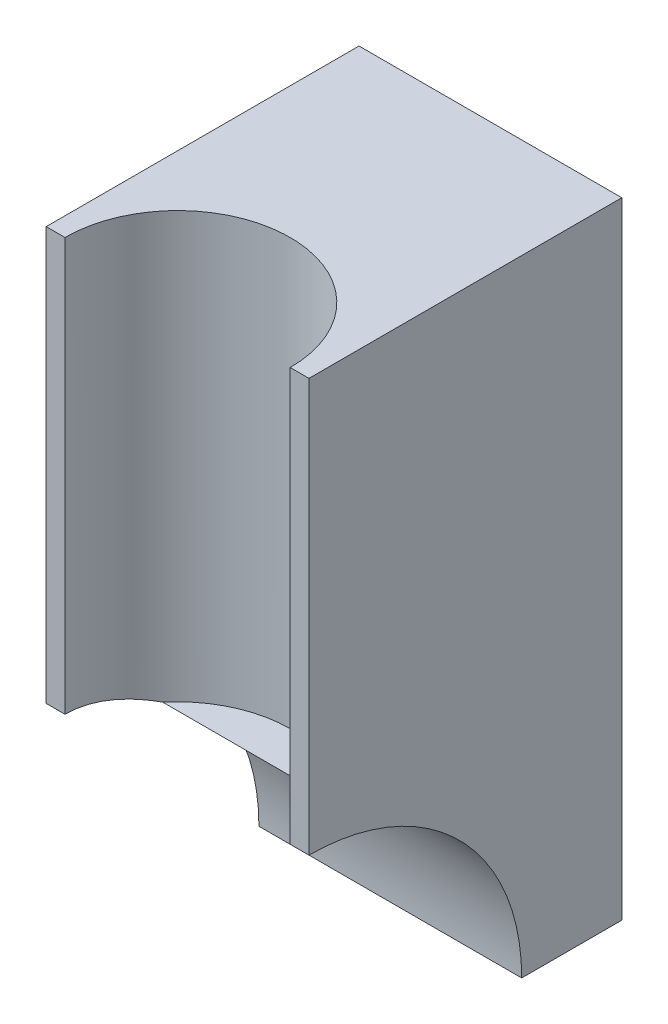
ISO-10303-21;
HEADER;
FILE_DESCRIPTION(('STEP AP214'),'2;1');
FILE_NAME('part.step','',(''),(''),'','','');
FILE_SCHEMA(('AUTOMOTIVE_DESIGN { 1 0 10303 214 1 1 1 1 }'));
ENDSEC;
DATA;
#1=APPLICATION_CONTEXT('core data for automotive mechanical design processes');
#2=APPLICATION_PROTOCOL_DEFINITION('international standard','automotive_design',2000,#1);
#3=PRODUCT_CONTEXT('',#1,'mechanical');
#4=PRODUCT('Part','Part','',(#3));
#5=PRODUCT_RELATED_PRODUCT_CATEGORY('part','',(#4));
#6=PRODUCT_DEFINITION_FORMATION('','',#4);
#7=PRODUCT_DEFINITION_CONTEXT('part definition',#1,'design');
#8=PRODUCT_DEFINITION('design','',#6,#7);
#9=PRODUCT_DEFINITION_SHAPE('','',#8);
#10=(LENGTH_UNIT() NAMED_UNIT(*) SI_UNIT(.MILLI.,.METRE.));
#11=(NAMED_UNIT(*) PLANE_ANGLE_UNIT() SI_UNIT($,.RADIAN.));
#12=(NAMED_UNIT(*) SI_UNIT($,.STERADIAN.) SOLID_ANGLE_UNIT());
#13=UNCERTAINTY_MEASURE_WITH_UNIT(LENGTH_MEASURE(1.E-05),#10,'distance_accuracy_value','');
#14=(GEOMETRIC_REPRESENTATION_CONTEXT(3) GLOBAL_UNCERTAINTY_ASSIGNED_CONTEXT((#13)) GLOBAL_UNIT_ASSIGNED_CONTEXT((#10,
#11,#12)) REPRESENTATION_CONTEXT('',''));
#15=CARTESIAN_POINT('',(0.,0.,0.));
#16=DIRECTION('',(0.,0.,1.));
#17=DIRECTION('',(1.,0.,0.));
#18=AXIS2_PLACEMENT_3D('',#15,#16,#17);
#19=CARTESIAN_POINT('',(-105.,500.,125.));
#20=DIRECTION('',(0.,0.,-1.));
#21=DIRECTION('',(-1.,0.,0.));
#22=AXIS2_PLACEMENT_3D('',#19,#20,#21);
#23=PLANE('',#22);
#24=DIRECTION('',(1.,0.,0.));
#25=VECTOR('',#24,1.);
#26=CARTESIAN_POINT('',(-105.,500.,125.));
#27=LINE('',#26,#25);
#28=CARTESIAN_POINT('',(90.,500.,125.));
#29=VERTEX_POINT('',#28);
#30=CARTESIAN_POINT('',(105.,500.,125.));
#31=VERTEX_POINT('',#30);
#32=EDGE_CURVE('E57',#29,#31,#27,.T.);
#33=ORIENTED_EDGE('',*,*,#32,.F.);
#34=DIRECTION('',(0.,1.,0.));
#35=VECTOR('',#34,1.);
#36=CARTESIAN_POINT('',(90.,160.,125.));
#37=LINE('',#36,#35);
#38=CARTESIAN_POINT('',(90.,170.,125.));
#39=VERTEX_POINT('',#38);
#40=EDGE_CURVE('E116',#29,#39,#37,.F.);
#41=ORIENTED_EDGE('',*,*,#40,.T.);
#42=DIRECTION('',(-1.,0.,0.));
#43=VECTOR('',#42,1.);
#44=CARTESIAN_POINT('',(920.199931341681,170.,125.));
#45=LINE('',#44,#43);
#46=CARTESIAN_POINT('',(105.,170.,125.));
#47=VERTEX_POINT('',#46);
#48=EDGE_CURVE('E122',#47,#39,#45,.T.);
#49=ORIENTED_EDGE('',*,*,#48,.F.);
#50=DIRECTION('',(0.,-1.,0.));
#51=VECTOR('',#50,1.);
#52=CARTESIAN_POINT('',(105.,500.,125.));
#53=LINE('',#52,#51);
#54=EDGE_CURVE('E165',#31,#47,#53,.T.);
#55=ORIENTED_EDGE('',*,*,#54,.F.);
#56=EDGE_LOOP('',(#33,#41,#49,#55));
#57=FACE_BOUND('',#56,.T.);
#58=ADVANCED_FACE('F30',(#57),#23,.F.);
#59=CARTESIAN_POINT('',(-90.,170.,125.));
#60=VERTEX_POINT('',#59);
#61=CARTESIAN_POINT('',(-105.,170.,125.));
#62=VERTEX_POINT('',#61);
#63=EDGE_CURVE('E202',#60,#62,#45,.T.);
#64=ORIENTED_EDGE('',*,*,#63,.F.);
#65=DIRECTION('',(0.,1.,0.));
#66=VECTOR('',#65,1.);
#67=CARTESIAN_POINT('',(-90.,160.,125.));
#68=LINE('',#67,#66);
#69=CARTESIAN_POINT('',(-90.,500.,125.));
#70=VERTEX_POINT('',#69);
#71=EDGE_CURVE('E203',#60,#70,#68,.T.);
#72=ORIENTED_EDGE('',*,*,#71,.T.);
#73=CARTESIAN_POINT('',(-105.,500.,125.));
#74=VERTEX_POINT('',#73);
#75=EDGE_CURVE('E161',#74,#70,#27,.T.);
#76=ORIENTED_EDGE('',*,*,#75,.F.);
#77=DIRECTION('',(0.,-1.,0.));
#78=VECTOR('',#77,1.);
#79=CARTESIAN_POINT('',(-105.,500.,125.));
#80=LINE('',#79,#78);
#81=EDGE_CURVE('E181',#74,#62,#80,.T.);
#82=ORIENTED_EDGE('',*,*,#81,.T.);
#83=EDGE_LOOP('',(#64,#72,#76,#82));
#84=FACE_BOUND('',#83,.T.);
#85=ADVANCED_FACE('F137',(#84),#23,.F.);
#86=CARTESIAN_POINT('',(105.,0.,125.));
#87=DIRECTION('',(0.,1.,0.));
#88=DIRECTION('',(0.,0.,1.));
#89=AXIS2_PLACEMENT_3D('',#86,#87,#88);
#90=PLANE('',#89);
#91=DIRECTION('',(-1.,0.,0.));
#92=VECTOR('',#91,1.);
#93=CARTESIAN_POINT('',(920.199931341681,0.,-45.0000000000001));
#94=LINE('',#93,#92);
#95=CARTESIAN_POINT('',(105.,0.,-45.));
#96=VERTEX_POINT('',#95);
#97=CARTESIAN_POINT('',(-105.,0.,-45.));
#98=VERTEX_POINT('',#97);
#99=EDGE_CURVE('E192',#96,#98,#94,.T.);
#100=ORIENTED_EDGE('',*,*,#99,.T.);
#101=DIRECTION('',(0.,0.,1.));
#102=VECTOR('',#101,1.);
#103=CARTESIAN_POINT('',(-105.,0.,-125.));
#104=LINE('',#103,#102);
#105=CARTESIAN_POINT('',(-105.,0.,-125.));
#106=VERTEX_POINT('',#105);
#107=EDGE_CURVE('E176',#106,#98,#104,.T.);
#108=ORIENTED_EDGE('',*,*,#107,.F.);
#109=DIRECTION('',(-1.,0.,0.));
#110=VECTOR('',#109,1.);
#111=CARTESIAN_POINT('',(-105.,0.,-125.));
#112=LINE('',#111,#110);
#113=CARTESIAN_POINT('',(105.,0.,-125.));
#114=VERTEX_POINT('',#113);
#115=EDGE_CURVE('E74',#114,#106,#112,.T.);
#116=ORIENTED_EDGE('',*,*,#115,.F.);
#117=DIRECTION('',(0.,0.,-1.));
#118=VECTOR('',#117,1.);
#119=CARTESIAN_POINT('',(105.,0.,-125.));
#120=LINE('',#119,#118);
#121=EDGE_CURVE('E172',#96,#114,#120,.T.);
#122=ORIENTED_EDGE('',*,*,#121,.F.);
#123=EDGE_LOOP('',(#100,#108,#116,#122));
#124=FACE_BOUND('',#123,.T.);
#125=ADVANCED_FACE('F143',(#124),#90,.F.);
#126=CARTESIAN_POINT('',(105.,500.,-125.));
#127=DIRECTION('',(-1.,0.,0.));
#128=DIRECTION('',(0.,0.,1.));
#129=AXIS2_PLACEMENT_3D('',#126,#127,#128);
#130=PLANE('',#129);
#131=CARTESIAN_POINT('',(105.,0.,125.));
#132=DIRECTION('',(-1.,0.,0.));
#133=DIRECTION('',(0.,0.,1.));
#134=AXIS2_PLACEMENT_3D('',#131,#132,#133);
#135=CIRCLE('',#134,170.);
#136=EDGE_CURVE('E174',#96,#47,#135,.F.);
#137=ORIENTED_EDGE('',*,*,#136,.F.);
#138=ORIENTED_EDGE('',*,*,#121,.T.);
#139=DIRECTION('',(0.,-1.,0.));
#140=VECTOR('',#139,1.);
#141=CARTESIAN_POINT('',(105.,500.,-125.));
#142=LINE('',#141,#140);
#143=CARTESIAN_POINT('',(105.,500.,-125.));
#144=VERTEX_POINT('',#143);
#145=EDGE_CURVE('E111',#144,#114,#142,.T.);
#146=ORIENTED_EDGE('',*,*,#145,.F.);
#147=DIRECTION('',(0.,0.,-1.));
#148=VECTOR('',#147,1.);
#149=CARTESIAN_POINT('',(105.,500.,-125.));
#150=LINE('',#149,#148);
#151=EDGE_CURVE('E179',#31,#144,#150,.T.);
#152=ORIENTED_EDGE('',*,*,#151,.F.);
#153=ORIENTED_EDGE('',*,*,#54,.T.);
#154=EDGE_LOOP('',(#137,#138,#146,#152,#153));
#155=FACE_BOUND('',#154,.T.);
#156=ADVANCED_FACE('F32',(#155),#130,.F.);
#157=CARTESIAN_POINT('',(-105.,500.,-125.));
#158=DIRECTION('',(1.,0.,0.));
#159=DIRECTION('',(0.,0.,-1.));
#160=AXIS2_PLACEMENT_3D('',#157,#158,#159);
#161=PLANE('',#160);
#162=CARTESIAN_POINT('',(-105.,0.,125.));
#163=DIRECTION('',(1.,0.,0.));
#164=DIRECTION('',(0.,0.,-1.));
#165=AXIS2_PLACEMENT_3D('',#162,#163,#164);
#166=CIRCLE('',#165,170.);
#167=EDGE_CURVE('E195',#62,#98,#166,.F.);
#168=ORIENTED_EDGE('',*,*,#167,.F.);
#169=ORIENTED_EDGE('',*,*,#81,.F.);
#170=DIRECTION('',(0.,0.,1.));
#171=VECTOR('',#170,1.);
#172=CARTESIAN_POINT('',(-105.,500.,-125.));
#173=LINE('',#172,#171);
#174=CARTESIAN_POINT('',(-105.,500.,-125.));
#175=VERTEX_POINT('',#174);
#176=EDGE_CURVE('E167',#175,#74,#173,.T.);
#177=ORIENTED_EDGE('',*,*,#176,.F.);
#178=DIRECTION('',(0.,-1.,0.));
#179=VECTOR('',#178,1.);
#180=CARTESIAN_POINT('',(-105.,500.,-125.));
#181=LINE('',#180,#179);
#182=EDGE_CURVE('E184',#175,#106,#181,.T.);
#183=ORIENTED_EDGE('',*,*,#182,.T.);
#184=ORIENTED_EDGE('',*,*,#107,.T.);
#185=EDGE_LOOP('',(#168,#169,#177,#183,#184));
#186=FACE_BOUND('',#185,.T.);
#187=ADVANCED_FACE('F147',(#186),#161,.F.);
#188=CARTESIAN_POINT('',(105.,500.,125.));
#189=DIRECTION('',(0.,1.,0.));
#190=DIRECTION('',(0.,0.,1.));
#191=AXIS2_PLACEMENT_3D('',#188,#189,#190);
#192=PLANE('',#191);
#193=CARTESIAN_POINT('',(0.,500.,125.));
#194=DIRECTION('',(0.,1.,0.));
#195=DIRECTION('',(0.,0.,1.));
#196=AXIS2_PLACEMENT_3D('',#193,#194,#195);
#197=CIRCLE('',#196,90.);
#198=EDGE_CURVE('E117',#29,#70,#197,.T.);
#199=ORIENTED_EDGE('',*,*,#198,.F.);
#200=ORIENTED_EDGE('',*,*,#32,.T.);
#201=ORIENTED_EDGE('',*,*,#151,.T.);
#202=DIRECTION('',(-1.,0.,0.));
#203=VECTOR('',#202,1.);
#204=CARTESIAN_POINT('',(-105.,500.,-125.));
#205=LINE('',#204,#203);
#206=EDGE_CURVE('E79',#144,#175,#205,.T.);
#207=ORIENTED_EDGE('',*,*,#206,.T.);
#208=ORIENTED_EDGE('',*,*,#176,.T.);
#209=ORIENTED_EDGE('',*,*,#75,.T.);
#210=EDGE_LOOP('',(#199,#200,#201,#207,#208,#209));
#211=FACE_BOUND('',#210,.T.);
#212=ADVANCED_FACE('F149',(#211),#192,.T.);
#213=CARTESIAN_POINT('',(-105.,500.,-125.));
#214=DIRECTION('',(0.,0.,1.));
#215=DIRECTION('',(1.,0.,0.));
#216=AXIS2_PLACEMENT_3D('',#213,#214,#215);
#217=PLANE('',#216);
#218=ORIENTED_EDGE('',*,*,#115,.T.);
#219=ORIENTED_EDGE('',*,*,#182,.F.);
#220=ORIENTED_EDGE('',*,*,#206,.F.);
#221=ORIENTED_EDGE('',*,*,#145,.T.);
#222=EDGE_LOOP('',(#218,#219,#220,#221));
#223=FACE_BOUND('',#222,.T.);
#224=ADVANCED_FACE('F151',(#223),#217,.F.);
#225=CARTESIAN_POINT('',(920.199931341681,0.,125.));
#226=DIRECTION('',(-1.,0.,0.));
#227=DIRECTION('',(0.,0.,1.));
#228=AXIS2_PLACEMENT_3D('',#225,#226,#227);
#229=CYLINDRICAL_SURFACE('',#228,170.);
#230=CARTESIAN_POINT('',(-90.,170.,125.));
#231=CARTESIAN_POINT('',(-90.0000268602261,170.000028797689,123.821788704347));
#232=CARTESIAN_POINT('',(-89.9768646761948,169.987752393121,122.643584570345));
#233=CARTESIAN_POINT('',(-89.8843571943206,169.938797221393,120.289530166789));
#234=CARTESIAN_POINT('',(-89.815013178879,169.90211913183,119.113679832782));
#235=CARTESIAN_POINT('',(-89.6303726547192,169.80458745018,116.767060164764));
#236=CARTESIAN_POINT('',(-89.515093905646,169.743743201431,115.596289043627));
#237=CARTESIAN_POINT('',(-89.2389604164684,169.598284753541,113.261618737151));
#238=CARTESIAN_POINT('',(-89.0781055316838,169.513670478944,112.097719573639));
#239=CARTESIAN_POINT('',(-88.7119235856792,169.321532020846,109.782793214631));
#240=CARTESIAN_POINT('',(-88.5067443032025,169.214083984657,108.631736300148));
#241=CARTESIAN_POINT('',(-88.0522042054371,168.97678268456,106.340593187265));
#242=CARTESIAN_POINT('',(-87.8028389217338,168.846927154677,105.200508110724));
#243=CARTESIAN_POINT('',(-87.2606892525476,168.565637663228,102.933502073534));
#244=CARTESIAN_POINT('',(-86.967908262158,168.414205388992,101.806580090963));
#245=CARTESIAN_POINT('',(-86.3397010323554,168.090664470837,99.5675773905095));
#246=CARTESIAN_POINT('',(-86.0042706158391,167.918553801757,98.4554981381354));
#247=CARTESIAN_POINT('',(-85.2922097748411,167.554968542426,96.2496937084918));
#248=CARTESIAN_POINT('',(-84.915641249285,167.363523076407,95.1559437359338));
#249=CARTESIAN_POINT('',(-84.1218125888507,166.962157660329,92.9866460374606));
#250=CARTESIAN_POINT('',(-83.7045485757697,166.752235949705,91.9111000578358));
#251=CARTESIAN_POINT('',(-82.8303341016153,166.315125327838,89.7798020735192));
#252=CARTESIAN_POINT('',(-82.3733830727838,166.087936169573,88.7240503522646));
#253=CARTESIAN_POINT('',(-81.4208149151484,165.617564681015,86.6337316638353));
#254=CARTESIAN_POINT('',(-80.9251944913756,165.374380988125,85.5991665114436));
#255=CARTESIAN_POINT('',(-79.3825912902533,164.62316978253,82.5306925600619));
#256=CARTESIAN_POINT('',(-78.2791251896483,164.0931087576,80.5302017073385));
#257=CARTESIAN_POINT('',(-75.9305833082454,162.985833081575,76.6292586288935));
#258=CARTESIAN_POINT('',(-74.6855668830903,162.408638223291,74.7287649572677));
#259=CARTESIAN_POINT('',(-72.7234726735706,161.518940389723,71.9664461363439));
#260=CARTESIAN_POINT('',(-72.0567752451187,161.219739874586,71.0641379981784));
#261=CARTESIAN_POINT('',(-71.0333336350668,160.765796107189,69.7317598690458));
#262=CARTESIAN_POINT('',(-70.6886002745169,160.613760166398,69.2915253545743));
#263=CARTESIAN_POINT('',(-69.9912160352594,160.308053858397,68.4178281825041));
#264=CARTESIAN_POINT('',(-69.6385639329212,160.154383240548,67.9843665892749));
#265=CARTESIAN_POINT('',(-69.2820323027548,160.,67.5543735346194));
#266=B_SPLINE_CURVE_WITH_KNOTS('',3,(#230,#231,#232,#233,#234,#235,#236,#237,#238,#239,#240,
#241,#242,#243,#244,#245,#246,#247,#248,#249,#250,#251,#252,#253,#254,#255,#256,#257,#258,#259,
#260,#261,#262,#263,#264,#265),.UNSPECIFIED.,.F.,.F.,(4,2,2,2,2,2,2,2,2,2,2,2,2,2,2,2,2,4),(0.,
3.53433105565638,7.06856397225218,10.6014317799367,14.1343108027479,17.6555880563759,
21.1772216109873,24.698579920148,28.2202833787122,31.7367590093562,35.2535700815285,
38.7704314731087,42.2875928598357,49.3159763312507,56.3414234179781,59.8240426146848,
61.562300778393,63.300829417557),.UNSPECIFIED.);
#267=CARTESIAN_POINT('',(-69.2820323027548,160.,67.5543735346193));
#268=VERTEX_POINT('',#267);
#269=EDGE_CURVE('E11',#60,#268,#266,.T.);
#270=ORIENTED_EDGE('',*,*,#269,.F.);
#271=ORIENTED_EDGE('',*,*,#63,.T.);
#272=ORIENTED_EDGE('',*,*,#167,.T.);
#273=ORIENTED_EDGE('',*,*,#99,.F.);
#274=ORIENTED_EDGE('',*,*,#136,.T.);
#275=ORIENTED_EDGE('',*,*,#48,.T.);
#276=CARTESIAN_POINT('',(69.2820323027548,160.,67.5543735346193));
#277=CARTESIAN_POINT('',(70.0432594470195,160.329630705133,68.4724454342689));
#278=CARTESIAN_POINT('',(70.7868233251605,160.656007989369,69.4063591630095));
#279=CARTESIAN_POINT('',(72.237546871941,161.300464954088,71.3048969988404));
#280=CARTESIAN_POINT('',(72.9447047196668,161.618544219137,72.2695226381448));
#281=CARTESIAN_POINT('',(74.3218418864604,162.244753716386,74.2289592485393));
#282=CARTESIAN_POINT('',(74.99180048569,162.552878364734,75.2237865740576));
#283=CARTESIAN_POINT('',(76.2929477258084,163.15723053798,77.2419888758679));
#284=CARTESIAN_POINT('',(76.9241368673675,163.4534582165,78.2653634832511));
#285=CARTESIAN_POINT('',(78.1501731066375,164.034009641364,80.3455866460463));
#286=CARTESIAN_POINT('',(78.7447838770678,164.318252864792,81.4025970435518));
#287=CARTESIAN_POINT('',(79.8923991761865,164.871291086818,83.5430429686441));
#288=CARTESIAN_POINT('',(80.4454004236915,165.140084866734,84.6264805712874));
#289=CARTESIAN_POINT('',(81.5083819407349,165.660501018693,86.8179825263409));
#290=CARTESIAN_POINT('',(82.018372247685,165.91212739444,87.9260410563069));
#291=CARTESIAN_POINT('',(82.9942391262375,166.396707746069,90.165419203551));
#292=CARTESIAN_POINT('',(83.4601161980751,166.629661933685,91.2967385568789));
#293=CARTESIAN_POINT('',(84.3482622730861,167.076274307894,93.5853058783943));
#294=CARTESIAN_POINT('',(84.7703565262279,167.289854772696,94.7426368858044));
#295=CARTESIAN_POINT('',(85.5676659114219,167.695282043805,97.0769702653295));
#296=CARTESIAN_POINT('',(85.9428854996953,167.887130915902,98.2539707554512));
#297=CARTESIAN_POINT('',(86.6454869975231,168.247881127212,100.626036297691));
#298=CARTESIAN_POINT('',(86.9728545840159,168.416775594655,101.821106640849));
#299=CARTESIAN_POINT('',(87.5785918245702,168.730384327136,104.226731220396));
#300=CARTESIAN_POINT('',(87.8569621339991,168.875098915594,105.437285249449));
#301=CARTESIAN_POINT('',(88.3626886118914,169.138754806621,107.866192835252));
#302=CARTESIAN_POINT('',(88.5902629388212,169.257806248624,109.08448898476));
#303=CARTESIAN_POINT('',(88.9951737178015,169.470089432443,111.531626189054));
#304=CARTESIAN_POINT('',(89.1725109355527,169.56332156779,112.760467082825));
#305=CARTESIAN_POINT('',(89.4762278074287,169.723241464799,115.225261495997));
#306=CARTESIAN_POINT('',(89.6026430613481,169.789947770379,116.461209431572));
#307=CARTESIAN_POINT('',(89.8042270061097,169.896414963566,118.938277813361));
#308=CARTESIAN_POINT('',(89.8794044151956,169.936180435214,120.179397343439));
#309=CARTESIAN_POINT('',(89.9525584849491,169.974887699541,122.017841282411));
#310=CARTESIAN_POINT('',(89.9703513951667,169.984305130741,122.614231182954));
#311=CARTESIAN_POINT('',(89.9940699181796,169.996860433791,123.80707332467));
#312=CARTESIAN_POINT('',(90.0000002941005,170.00000082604,124.403525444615));
#313=CARTESIAN_POINT('',(90.,170.,125.));
#314=B_SPLINE_CURVE_WITH_KNOTS('',3,(#276,#277,#278,#279,#280,#281,#282,#283,#284,#285,#286,
#287,#288,#289,#290,#291,#292,#293,#294,#295,#296,#297,#298,#299,#300,#301,#302,#303,#304,#305,
#306,#307,#308,#309,#310,#311,#312,#313),.UNSPECIFIED.,.F.,.F.,(4,2,2,2,2,2,2,2,2,2,2,2,2,2,2,2,
2,2,4),(0.,3.71178200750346,7.42374948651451,11.1377641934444,14.8517309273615,18.5876047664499,
22.323772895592,26.0590666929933,29.7943181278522,33.5439466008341,37.2932183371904,
41.0436100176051,44.7939515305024,48.5278621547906,52.2617158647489,55.9929546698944,
59.7235584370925,61.5136184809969,63.3029596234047),.UNSPECIFIED.);
#315=CARTESIAN_POINT('',(69.2820323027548,160.,67.5543735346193));
#316=VERTEX_POINT('',#315);
#317=EDGE_CURVE('E43',#316,#39,#314,.T.);
#318=ORIENTED_EDGE('',*,*,#317,.F.);
#319=DIRECTION('',(-1.,0.,0.));
#320=VECTOR('',#319,1.);
#321=CARTESIAN_POINT('',(920.199931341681,160.,67.5543735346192));
#322=LINE('',#321,#320);
#323=EDGE_CURVE('E106',#316,#268,#322,.T.);
#324=ORIENTED_EDGE('',*,*,#323,.T.);
#325=EDGE_LOOP('',(#270,#271,#272,#273,#274,#275,#318,#324));
#326=FACE_BOUND('',#325,.T.);
#327=ADVANCED_FACE('F120',(#326),#229,.F.);
#328=CARTESIAN_POINT('',(0.,160.,125.));
#329=DIRECTION('',(0.,1.,0.));
#330=DIRECTION('',(0.,0.,1.));
#331=AXIS2_PLACEMENT_3D('',#328,#329,#330);
#332=CYLINDRICAL_SURFACE('',#331,90.);
#333=ORIENTED_EDGE('',*,*,#269,.T.);
#334=CARTESIAN_POINT('',(0.,160.,125.));
#335=DIRECTION('',(0.,1.,0.));
#336=DIRECTION('',(0.,0.,1.));
#337=AXIS2_PLACEMENT_3D('',#334,#335,#336);
#338=CIRCLE('',#337,90.);
#339=EDGE_CURVE('E49',#316,#268,#338,.T.);
#340=ORIENTED_EDGE('',*,*,#339,.F.);
#341=ORIENTED_EDGE('',*,*,#317,.T.);
#342=ORIENTED_EDGE('',*,*,#40,.F.);
#343=ORIENTED_EDGE('',*,*,#198,.T.);
#344=ORIENTED_EDGE('',*,*,#71,.F.);
#345=EDGE_LOOP('',(#333,#340,#341,#342,#343,#344));
#346=FACE_BOUND('',#345,.T.);
#347=ADVANCED_FACE('F114',(#346),#332,.F.);
#348=CARTESIAN_POINT('',(0.,160.,125.));
#349=DIRECTION('',(0.,1.,0.));
#350=DIRECTION('',(0.,0.,1.));
#351=AXIS2_PLACEMENT_3D('',#348,#349,#350);
#352=PLANE('',#351);
#353=ORIENTED_EDGE('',*,*,#339,.T.);
#354=ORIENTED_EDGE('',*,*,#323,.F.);
#355=EDGE_LOOP('',(#353,#354));
#356=FACE_BOUND('',#355,.T.);
#357=ADVANCED_FACE('F107',(#356),#352,.T.);
#358=CLOSED_SHELL('',(#58,#85,#125,#156,#187,#212,#224,#327,#347,#357));
#359=MANIFOLD_SOLID_BREP('B2',#358);
#360=ADVANCED_BREP_SHAPE_REPRESENTATION('',(#18,#359),#14);
#361=SHAPE_DEFINITION_REPRESENTATION(#9,#360);
ENDSEC;
END-ISO-10303-21;
